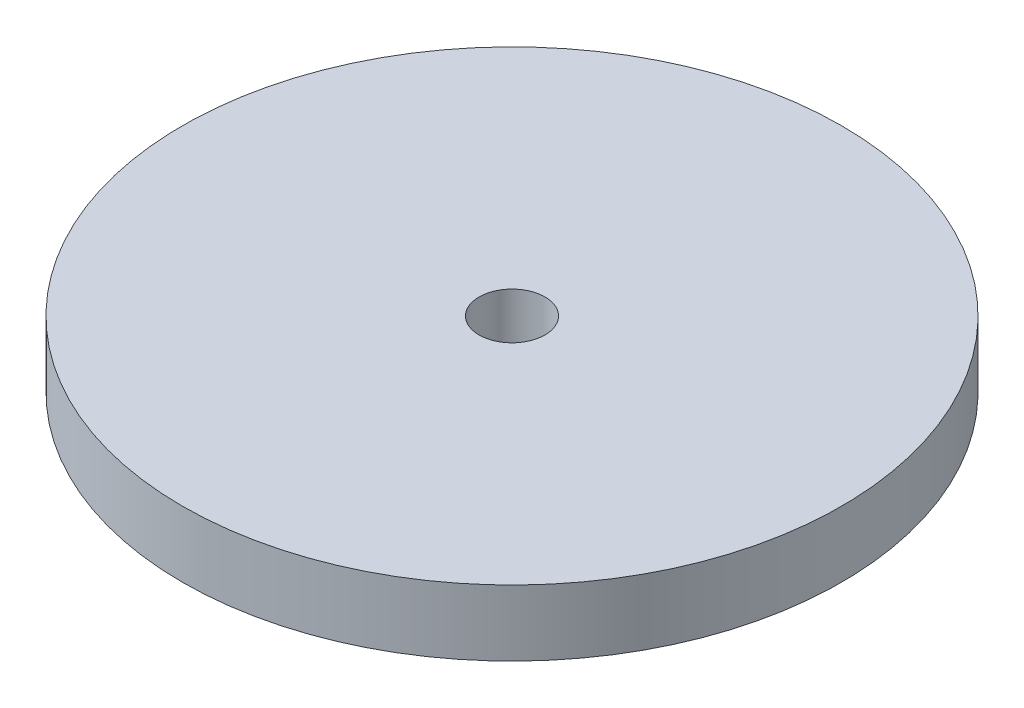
from build123d import *

# Parameters (mm, degrees)
SKETCH1_R      = 31.75
SKETCH1_R_2    = 3.175
EXTRUDE1_DEPTH = 6.35


with BuildPart() as part:
    # Sketch1 → Extrude1 (new body)
    with BuildSketch(Plane(origin=(0, 0, 0), x_dir=(1, 0, 0), z_dir=(0, 1, 0))):
        with Locations(Location((-8.470010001, 3.257696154, 0), (0, 0, 270))):
            Circle(SKETCH1_R)
        with Locations(Location((-8.470010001, 3.257696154, 0), (0, 0, 270))):
            Circle(SKETCH1_R_2, mode=Mode.SUBTRACT)
    extrude(amount=EXTRUDE1_DEPTH)


solid = part.part
